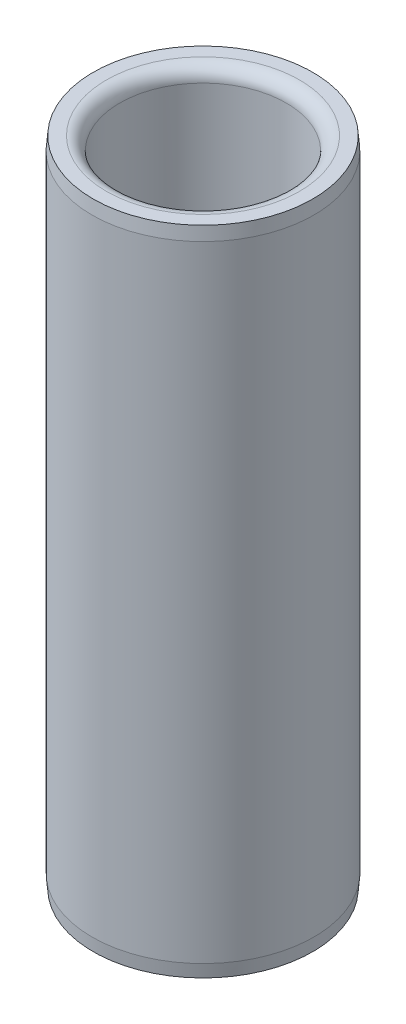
ISO-10303-21;
HEADER;
FILE_DESCRIPTION(('STEP AP214'),'2;1');
FILE_NAME('part.step','',(''),(''),'','','');
FILE_SCHEMA(('AUTOMOTIVE_DESIGN { 1 0 10303 214 1 1 1 1 }'));
ENDSEC;
DATA;
#1=APPLICATION_CONTEXT('core data for automotive mechanical design processes');
#2=APPLICATION_PROTOCOL_DEFINITION('international standard','automotive_design',2000,#1);
#3=PRODUCT_CONTEXT('',#1,'mechanical');
#4=PRODUCT('Part','Part','',(#3));
#5=PRODUCT_RELATED_PRODUCT_CATEGORY('part','',(#4));
#6=PRODUCT_DEFINITION_FORMATION('','',#4);
#7=PRODUCT_DEFINITION_CONTEXT('part definition',#1,'design');
#8=PRODUCT_DEFINITION('design','',#6,#7);
#9=PRODUCT_DEFINITION_SHAPE('','',#8);
#10=(LENGTH_UNIT() NAMED_UNIT(*) SI_UNIT(.MILLI.,.METRE.));
#11=(NAMED_UNIT(*) PLANE_ANGLE_UNIT() SI_UNIT($,.RADIAN.));
#12=(NAMED_UNIT(*) SI_UNIT($,.STERADIAN.) SOLID_ANGLE_UNIT());
#13=UNCERTAINTY_MEASURE_WITH_UNIT(LENGTH_MEASURE(1.E-05),#10,'distance_accuracy_value','');
#14=(GEOMETRIC_REPRESENTATION_CONTEXT(3) GLOBAL_UNCERTAINTY_ASSIGNED_CONTEXT((#13)) GLOBAL_UNIT_ASSIGNED_CONTEXT((#10,
#11,#12)) REPRESENTATION_CONTEXT('',''));
#15=CARTESIAN_POINT('',(0.,0.,0.));
#16=DIRECTION('',(0.,0.,1.));
#17=DIRECTION('',(1.,0.,0.));
#18=AXIS2_PLACEMENT_3D('',#15,#16,#17);
#19=CARTESIAN_POINT('',(0.,20.0804824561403,0.));
#20=DIRECTION('',(0.,1.,0.));
#21=DIRECTION('',(0.,0.,1.));
#22=AXIS2_PLACEMENT_3D('',#19,#20,#21);
#23=CYLINDRICAL_SURFACE('',#22,19.05635);
#24=CARTESIAN_POINT('',(0.,3.048,0.));
#25=DIRECTION('',(0.,-1.,0.));
#26=DIRECTION('',(0.,0.,-1.));
#27=AXIS2_PLACEMENT_3D('',#24,#25,#26);
#28=CIRCLE('',#27,19.05635);
#29=CARTESIAN_POINT('',(0.,3.048,-19.05635));
#30=VERTEX_POINT('',#29);
#31=EDGE_CURVE('E37',#30,#30,#28,.T.);
#32=ORIENTED_EDGE('',*,*,#31,.T.);
#33=EDGE_LOOP('',(#32));
#34=FACE_BOUND('',#33,.T.);
#35=CARTESIAN_POINT('',(0.,146.177,0.));
#36=DIRECTION('',(0.,1.,0.));
#37=DIRECTION('',(0.,0.,1.));
#38=AXIS2_PLACEMENT_3D('',#35,#36,#37);
#39=CIRCLE('',#38,19.05635);
#40=CARTESIAN_POINT('',(0.,146.177,19.05635));
#41=VERTEX_POINT('',#40);
#42=EDGE_CURVE('E41',#41,#41,#39,.T.);
#43=ORIENTED_EDGE('',*,*,#42,.T.);
#44=EDGE_LOOP('',(#43));
#45=FACE_BOUND('',#44,.T.);
#46=ADVANCED_FACE('F30',(#34,#45),#23,.F.);
#47=CARTESIAN_POINT('',(-19.05635,0.,0.));
#48=DIRECTION('',(0.,-1.,0.));
#49=DIRECTION('',(0.,0.,-1.));
#50=AXIS2_PLACEMENT_3D('',#47,#48,#49);
#51=PLANE('',#50);
#52=CARTESIAN_POINT('',(0.,0.,0.));
#53=DIRECTION('',(0.,-1.,0.));
#54=DIRECTION('',(0.,0.,-1.));
#55=AXIS2_PLACEMENT_3D('',#52,#53,#54);
#56=CIRCLE('',#55,22.10435);
#57=CARTESIAN_POINT('',(0.,0.,-22.10435));
#58=VERTEX_POINT('',#57);
#59=EDGE_CURVE('E45',#58,#58,#56,.F.);
#60=ORIENTED_EDGE('',*,*,#59,.T.);
#61=EDGE_LOOP('',(#60));
#62=FACE_BOUND('',#61,.T.);
#63=CARTESIAN_POINT('',(0.,0.,0.));
#64=DIRECTION('',(0.,-1.,0.));
#65=DIRECTION('',(0.,0.,-1.));
#66=AXIS2_PLACEMENT_3D('',#63,#64,#65);
#67=CIRCLE('',#66,25.1333345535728);
#68=CARTESIAN_POINT('',(0.,0.,-25.1333345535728));
#69=VERTEX_POINT('',#68);
#70=EDGE_CURVE('E53',#69,#69,#67,.T.);
#71=ORIENTED_EDGE('',*,*,#70,.T.);
#72=EDGE_LOOP('',(#71));
#73=FACE_BOUND('',#72,.T.);
#74=ADVANCED_FACE('F82',(#62,#73),#51,.T.);
#75=CARTESIAN_POINT('',(0.,20.0804824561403,0.));
#76=DIRECTION('',(0.,1.,0.));
#77=DIRECTION('',(0.,0.,1.));
#78=AXIS2_PLACEMENT_3D('',#75,#76,#77);
#79=CYLINDRICAL_SURFACE('',#78,25.4);
#80=CARTESIAN_POINT('',(0.,3.04800000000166,0.));
#81=DIRECTION('',(0.,-1.,0.));
#82=DIRECTION('',(0.,0.,-1.));
#83=AXIS2_PLACEMENT_3D('',#80,#81,#82);
#84=CIRCLE('',#83,25.4);
#85=CARTESIAN_POINT('',(0.,3.04800000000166,-25.4));
#86=VERTEX_POINT('',#85);
#87=EDGE_CURVE('E56',#86,#86,#84,.F.);
#88=ORIENTED_EDGE('',*,*,#87,.T.);
#89=EDGE_LOOP('',(#88));
#90=FACE_BOUND('',#89,.T.);
#91=CARTESIAN_POINT('',(0.,146.177,0.));
#92=DIRECTION('',(0.,1.,0.));
#93=DIRECTION('',(0.,0.,1.));
#94=AXIS2_PLACEMENT_3D('',#91,#92,#93);
#95=CIRCLE('',#94,25.4);
#96=CARTESIAN_POINT('',(0.,146.177,25.4));
#97=VERTEX_POINT('',#96);
#98=EDGE_CURVE('E59',#97,#97,#95,.F.);
#99=ORIENTED_EDGE('',*,*,#98,.T.);
#100=EDGE_LOOP('',(#99));
#101=FACE_BOUND('',#100,.T.);
#102=ADVANCED_FACE('F63',(#90,#101),#79,.T.);
#103=CARTESIAN_POINT('',(-25.4,149.225,0.));
#104=DIRECTION('',(0.,1.,0.));
#105=DIRECTION('',(0.,0.,1.));
#106=AXIS2_PLACEMENT_3D('',#103,#104,#105);
#107=PLANE('',#106);
#108=CARTESIAN_POINT('',(0.,149.225,0.));
#109=DIRECTION('',(0.,1.,0.));
#110=DIRECTION('',(0.,0.,1.));
#111=AXIS2_PLACEMENT_3D('',#108,#109,#110);
#112=CIRCLE('',#111,22.10435);
#113=CARTESIAN_POINT('',(0.,149.225,22.10435));
#114=VERTEX_POINT('',#113);
#115=EDGE_CURVE('E10',#114,#114,#112,.F.);
#116=ORIENTED_EDGE('',*,*,#115,.T.);
#117=EDGE_LOOP('',(#116));
#118=FACE_BOUND('',#117,.T.);
#119=CARTESIAN_POINT('',(0.,149.225,0.));
#120=DIRECTION('',(0.,1.,0.));
#121=DIRECTION('',(0.,0.,1.));
#122=AXIS2_PLACEMENT_3D('',#119,#120,#121);
#123=CIRCLE('',#122,25.133334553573);
#124=CARTESIAN_POINT('',(0.,149.225,25.133334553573));
#125=VERTEX_POINT('',#124);
#126=EDGE_CURVE('E50',#125,#125,#123,.T.);
#127=ORIENTED_EDGE('',*,*,#126,.T.);
#128=EDGE_LOOP('',(#127));
#129=FACE_BOUND('',#128,.T.);
#130=ADVANCED_FACE('F73',(#118,#129),#107,.T.);
#131=CARTESIAN_POINT('',(0.,3.04800000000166,0.));
#132=DIRECTION('',(0.,1.,0.));
#133=DIRECTION('',(0.,0.,1.));
#134=AXIS2_PLACEMENT_3D('',#131,#132,#133);
#135=CONICAL_SURFACE('',#134,25.4,0.0872664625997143);
#136=ORIENTED_EDGE('',*,*,#70,.F.);
#137=EDGE_LOOP('',(#136));
#138=FACE_BOUND('',#137,.T.);
#139=ORIENTED_EDGE('',*,*,#87,.F.);
#140=EDGE_LOOP('',(#139));
#141=FACE_BOUND('',#140,.T.);
#142=ADVANCED_FACE('F69',(#138,#141),#135,.T.);
#143=CARTESIAN_POINT('',(0.,149.225,0.));
#144=DIRECTION('',(0.,-1.,0.));
#145=DIRECTION('',(0.,0.,-1.));
#146=AXIS2_PLACEMENT_3D('',#143,#144,#145);
#147=CONICAL_SURFACE('',#146,25.133334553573,0.0872664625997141);
#148=ORIENTED_EDGE('',*,*,#98,.F.);
#149=EDGE_LOOP('',(#148));
#150=FACE_BOUND('',#149,.T.);
#151=ORIENTED_EDGE('',*,*,#126,.F.);
#152=EDGE_LOOP('',(#151));
#153=FACE_BOUND('',#152,.T.);
#154=ADVANCED_FACE('F65',(#150,#153),#147,.T.);
#155=CARTESIAN_POINT('',(0.,3.048,0.));
#156=DIRECTION('',(0.,-1.,0.));
#157=DIRECTION('',(0.,0.,-1.));
#158=AXIS2_PLACEMENT_3D('',#155,#156,#157);
#159=TOROIDAL_SURFACE('',#158,22.10435,3.048);
#160=ORIENTED_EDGE('',*,*,#31,.F.);
#161=EDGE_LOOP('',(#160));
#162=FACE_BOUND('',#161,.T.);
#163=ORIENTED_EDGE('',*,*,#59,.F.);
#164=EDGE_LOOP('',(#163));
#165=FACE_BOUND('',#164,.T.);
#166=ADVANCED_FACE('F68',(#162,#165),#159,.T.);
#167=CARTESIAN_POINT('',(0.,146.177,0.));
#168=DIRECTION('',(0.,1.,0.));
#169=DIRECTION('',(0.,0.,1.));
#170=AXIS2_PLACEMENT_3D('',#167,#168,#169);
#171=TOROIDAL_SURFACE('',#170,22.10435,3.048);
#172=ORIENTED_EDGE('',*,*,#115,.F.);
#173=EDGE_LOOP('',(#172));
#174=FACE_BOUND('',#173,.T.);
#175=ORIENTED_EDGE('',*,*,#42,.F.);
#176=EDGE_LOOP('',(#175));
#177=FACE_BOUND('',#176,.T.);
#178=ADVANCED_FACE('F32',(#174,#177),#171,.T.);
#179=CLOSED_SHELL('',(#46,#74,#102,#130,#142,#154,#166,#178));
#180=MANIFOLD_SOLID_BREP('B2',#179);
#181=ADVANCED_BREP_SHAPE_REPRESENTATION('',(#18,#180),#14);
#182=SHAPE_DEFINITION_REPRESENTATION(#9,#181);
ENDSEC;
END-ISO-10303-21;
